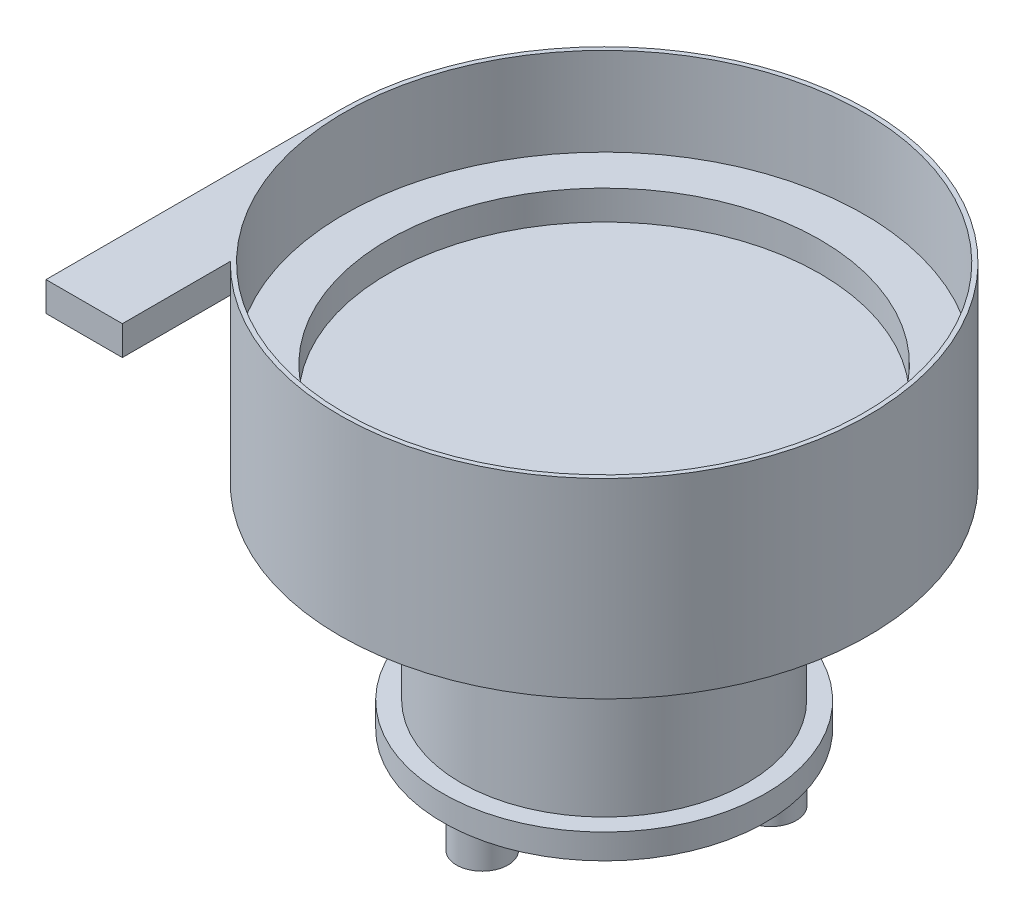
ISO-10303-21;
HEADER;
FILE_DESCRIPTION(('STEP AP214'),'2;1');
FILE_NAME('part.step','',(''),(''),'','','');
FILE_SCHEMA(('AUTOMOTIVE_DESIGN { 1 0 10303 214 1 1 1 1 }'));
ENDSEC;
DATA;
#1=APPLICATION_CONTEXT('core data for automotive mechanical design processes');
#2=APPLICATION_PROTOCOL_DEFINITION('international standard','automotive_design',2000,#1);
#3=PRODUCT_CONTEXT('',#1,'mechanical');
#4=PRODUCT('Part','Part','',(#3));
#5=PRODUCT_RELATED_PRODUCT_CATEGORY('part','',(#4));
#6=PRODUCT_DEFINITION_FORMATION('','',#4);
#7=PRODUCT_DEFINITION_CONTEXT('part definition',#1,'design');
#8=PRODUCT_DEFINITION('design','',#6,#7);
#9=PRODUCT_DEFINITION_SHAPE('','',#8);
#10=(LENGTH_UNIT() NAMED_UNIT(*) SI_UNIT(.MILLI.,.METRE.));
#11=(NAMED_UNIT(*) PLANE_ANGLE_UNIT() SI_UNIT($,.RADIAN.));
#12=(NAMED_UNIT(*) SI_UNIT($,.STERADIAN.) SOLID_ANGLE_UNIT());
#13=UNCERTAINTY_MEASURE_WITH_UNIT(LENGTH_MEASURE(1.E-05),#10,'distance_accuracy_value','');
#14=(GEOMETRIC_REPRESENTATION_CONTEXT(3) GLOBAL_UNCERTAINTY_ASSIGNED_CONTEXT((#13)) GLOBAL_UNIT_ASSIGNED_CONTEXT((#10,
#11,#12)) REPRESENTATION_CONTEXT('',''));
#15=CARTESIAN_POINT('',(0.,0.,0.));
#16=DIRECTION('',(0.,0.,1.));
#17=DIRECTION('',(1.,0.,0.));
#18=AXIS2_PLACEMENT_3D('',#15,#16,#17);
#19=CARTESIAN_POINT('',(0.,0.,0.));
#20=DIRECTION('',(0.,-1.,0.));
#21=DIRECTION('',(0.,0.,-1.));
#22=AXIS2_PLACEMENT_3D('',#19,#20,#21);
#23=CYLINDRICAL_SURFACE('',#22,180.);
#24=CARTESIAN_POINT('',(0.,145.,0.));
#25=DIRECTION('',(0.,-1.,0.));
#26=DIRECTION('',(0.,0.,-1.));
#27=AXIS2_PLACEMENT_3D('',#24,#25,#26);
#28=CIRCLE('',#27,180.);
#29=CARTESIAN_POINT('',(0.,145.,-180.));
#30=VERTEX_POINT('',#29);
#31=EDGE_CURVE('E116',#30,#30,#28,.T.);
#32=ORIENTED_EDGE('',*,*,#31,.F.);
#33=EDGE_LOOP('',(#32));
#34=FACE_BOUND('',#33,.T.);
#35=CARTESIAN_POINT('',(0.,275.,0.));
#36=DIRECTION('',(0.,-1.,0.));
#37=DIRECTION('',(0.,0.,-1.));
#38=AXIS2_PLACEMENT_3D('',#35,#36,#37);
#39=CIRCLE('',#38,180.);
#40=CARTESIAN_POINT('',(-180.,275.,0.));
#41=VERTEX_POINT('',#40);
#42=CARTESIAN_POINT('',(-128.,275.,126.554336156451));
#43=VERTEX_POINT('',#42);
#44=EDGE_CURVE('E111',#41,#43,#39,.T.);
#45=ORIENTED_EDGE('',*,*,#44,.T.);
#46=DIRECTION('',(0.,-1.,0.));
#47=VECTOR('',#46,1.);
#48=CARTESIAN_POINT('',(-128.,0.,126.554336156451));
#49=LINE('',#48,#47);
#50=CARTESIAN_POINT('',(-128.,255.,126.554336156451));
#51=VERTEX_POINT('',#50);
#52=EDGE_CURVE('E74',#43,#51,#49,.T.);
#53=ORIENTED_EDGE('',*,*,#52,.T.);
#54=CARTESIAN_POINT('',(0.,255.,0.));
#55=DIRECTION('',(0.,1.,0.));
#56=DIRECTION('',(0.,0.,1.));
#57=AXIS2_PLACEMENT_3D('',#54,#55,#56);
#58=CIRCLE('',#57,180.);
#59=CARTESIAN_POINT('',(-180.,255.,0.));
#60=VERTEX_POINT('',#59);
#61=EDGE_CURVE('E39',#51,#60,#58,.F.);
#62=ORIENTED_EDGE('',*,*,#61,.T.);
#63=DIRECTION('',(0.,-1.,0.));
#64=VECTOR('',#63,1.);
#65=CARTESIAN_POINT('',(-180.,275.,0.));
#66=LINE('',#65,#64);
#67=EDGE_CURVE('E71',#41,#60,#66,.T.);
#68=ORIENTED_EDGE('',*,*,#67,.F.);
#69=EDGE_LOOP('',(#45,#53,#62,#68));
#70=FACE_BOUND('',#69,.T.);
#71=ADVANCED_FACE('F16',(#34,#70),#23,.T.);
#72=CARTESIAN_POINT('',(0.,215.,0.));
#73=DIRECTION('',(0.,1.,0.));
#74=DIRECTION('',(0.,0.,1.));
#75=AXIS2_PLACEMENT_3D('',#72,#73,#74);
#76=CYLINDRICAL_SURFACE('',#75,177.);
#77=CARTESIAN_POINT('',(0.,275.,0.));
#78=DIRECTION('',(0.,1.,0.));
#79=DIRECTION('',(0.,0.,1.));
#80=AXIS2_PLACEMENT_3D('',#77,#78,#79);
#81=CIRCLE('',#80,177.);
#82=CARTESIAN_POINT('',(0.,275.,177.));
#83=VERTEX_POINT('',#82);
#84=EDGE_CURVE('E87',#83,#83,#81,.T.);
#85=ORIENTED_EDGE('',*,*,#84,.T.);
#86=EDGE_LOOP('',(#85));
#87=FACE_BOUND('',#86,.T.);
#88=CARTESIAN_POINT('',(0.,215.,0.));
#89=DIRECTION('',(0.,1.,0.));
#90=DIRECTION('',(0.,0.,1.));
#91=AXIS2_PLACEMENT_3D('',#88,#89,#90);
#92=CIRCLE('',#91,177.);
#93=CARTESIAN_POINT('',(0.,215.,177.));
#94=VERTEX_POINT('',#93);
#95=EDGE_CURVE('E90',#94,#94,#92,.T.);
#96=ORIENTED_EDGE('',*,*,#95,.F.);
#97=EDGE_LOOP('',(#96));
#98=FACE_BOUND('',#97,.T.);
#99=ADVANCED_FACE('F145',(#87,#98),#76,.F.);
#100=CARTESIAN_POINT('',(0.,0.,0.));
#101=DIRECTION('',(0.,-1.,0.));
#102=DIRECTION('',(0.,0.,-1.));
#103=AXIS2_PLACEMENT_3D('',#100,#101,#102);
#104=PLANE('',#103);
#105=CARTESIAN_POINT('',(-71.8801085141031,0.,-41.5000000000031));
#106=DIRECTION('',(0.,-1.,0.));
#107=DIRECTION('',(0.,0.,-1.));
#108=AXIS2_PLACEMENT_3D('',#105,#106,#107);
#109=CIRCLE('',#108,17.5000000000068);
#110=CARTESIAN_POINT('',(-71.8801085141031,0.,-59.0000000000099));
#111=VERTEX_POINT('',#110);
#112=EDGE_CURVE('E93',#111,#111,#109,.T.);
#113=ORIENTED_EDGE('',*,*,#112,.F.);
#114=EDGE_LOOP('',(#113));
#115=FACE_BOUND('',#114,.T.);
#116=CARTESIAN_POINT('',(71.8801085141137,0.,-41.499999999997));
#117=DIRECTION('',(0.,-1.,0.));
#118=DIRECTION('',(0.,0.,-1.));
#119=AXIS2_PLACEMENT_3D('',#116,#117,#118);
#120=CIRCLE('',#119,17.5000000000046);
#121=CARTESIAN_POINT('',(71.8801085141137,0.,-59.0000000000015));
#122=VERTEX_POINT('',#121);
#123=EDGE_CURVE('E99',#122,#122,#120,.T.);
#124=ORIENTED_EDGE('',*,*,#123,.F.);
#125=EDGE_LOOP('',(#124));
#126=FACE_BOUND('',#125,.T.);
#127=CARTESIAN_POINT('',(0.,0.,83.));
#128=DIRECTION('',(0.,-1.,0.));
#129=DIRECTION('',(0.,0.,-1.));
#130=AXIS2_PLACEMENT_3D('',#127,#128,#129);
#131=CIRCLE('',#130,17.5);
#132=CARTESIAN_POINT('',(0.,0.,65.5));
#133=VERTEX_POINT('',#132);
#134=EDGE_CURVE('E105',#133,#133,#131,.T.);
#135=ORIENTED_EDGE('',*,*,#134,.F.);
#136=EDGE_LOOP('',(#135));
#137=FACE_BOUND('',#136,.T.);
#138=CARTESIAN_POINT('',(0.,0.,0.));
#139=DIRECTION('',(0.,-1.,0.));
#140=DIRECTION('',(0.,0.,-1.));
#141=AXIS2_PLACEMENT_3D('',#138,#139,#140);
#142=CIRCLE('',#141,110.);
#143=CARTESIAN_POINT('',(0.,0.,-110.));
#144=VERTEX_POINT('',#143);
#145=EDGE_CURVE('E11',#144,#144,#142,.T.);
#146=ORIENTED_EDGE('',*,*,#145,.T.);
#147=EDGE_LOOP('',(#146));
#148=FACE_BOUND('',#147,.T.);
#149=ADVANCED_FACE('F18',(#115,#126,#137,#148),#104,.T.);
#150=CARTESIAN_POINT('',(0.,0.,0.));
#151=DIRECTION('',(0.,-1.,0.));
#152=DIRECTION('',(0.,0.,-1.));
#153=AXIS2_PLACEMENT_3D('',#150,#151,#152);
#154=CYLINDRICAL_SURFACE('',#153,110.);
#155=CARTESIAN_POINT('',(0.,17.,0.));
#156=DIRECTION('',(0.,-1.,0.));
#157=DIRECTION('',(0.,0.,-1.));
#158=AXIS2_PLACEMENT_3D('',#155,#156,#157);
#159=CIRCLE('',#158,110.);
#160=CARTESIAN_POINT('',(0.,17.,-110.));
#161=VERTEX_POINT('',#160);
#162=EDGE_CURVE('E24',#161,#161,#159,.T.);
#163=ORIENTED_EDGE('',*,*,#162,.T.);
#164=EDGE_LOOP('',(#163));
#165=FACE_BOUND('',#164,.T.);
#166=ORIENTED_EDGE('',*,*,#145,.F.);
#167=EDGE_LOOP('',(#166));
#168=FACE_BOUND('',#167,.T.);
#169=ADVANCED_FACE('F127',(#165,#168),#154,.T.);
#170=CARTESIAN_POINT('',(110.,17.,0.));
#171=DIRECTION('',(0.,1.,0.));
#172=DIRECTION('',(0.,0.,1.));
#173=AXIS2_PLACEMENT_3D('',#170,#171,#172);
#174=PLANE('',#173);
#175=CARTESIAN_POINT('',(0.,17.,0.));
#176=DIRECTION('',(0.,-1.,0.));
#177=DIRECTION('',(0.,0.,-1.));
#178=AXIS2_PLACEMENT_3D('',#175,#176,#177);
#179=CIRCLE('',#178,97.5);
#180=CARTESIAN_POINT('',(0.,17.,-97.5));
#181=VERTEX_POINT('',#180);
#182=EDGE_CURVE('E122',#181,#181,#179,.T.);
#183=ORIENTED_EDGE('',*,*,#182,.T.);
#184=EDGE_LOOP('',(#183));
#185=FACE_BOUND('',#184,.T.);
#186=ORIENTED_EDGE('',*,*,#162,.F.);
#187=EDGE_LOOP('',(#186));
#188=FACE_BOUND('',#187,.T.);
#189=ADVANCED_FACE('F130',(#185,#188),#174,.T.);
#190=CARTESIAN_POINT('',(0.,0.,0.));
#191=DIRECTION('',(0.,-1.,0.));
#192=DIRECTION('',(0.,0.,-1.));
#193=AXIS2_PLACEMENT_3D('',#190,#191,#192);
#194=CYLINDRICAL_SURFACE('',#193,97.5);
#195=CARTESIAN_POINT('',(0.,145.,0.));
#196=DIRECTION('',(0.,-1.,0.));
#197=DIRECTION('',(0.,0.,-1.));
#198=AXIS2_PLACEMENT_3D('',#195,#196,#197);
#199=CIRCLE('',#198,97.5);
#200=CARTESIAN_POINT('',(0.,145.,-97.5));
#201=VERTEX_POINT('',#200);
#202=EDGE_CURVE('E119',#201,#201,#199,.T.);
#203=ORIENTED_EDGE('',*,*,#202,.T.);
#204=EDGE_LOOP('',(#203));
#205=FACE_BOUND('',#204,.T.);
#206=ORIENTED_EDGE('',*,*,#182,.F.);
#207=EDGE_LOOP('',(#206));
#208=FACE_BOUND('',#207,.T.);
#209=ADVANCED_FACE('F132',(#205,#208),#194,.T.);
#210=CARTESIAN_POINT('',(97.5,145.,0.));
#211=DIRECTION('',(0.,-1.,0.));
#212=DIRECTION('',(0.,0.,-1.));
#213=AXIS2_PLACEMENT_3D('',#210,#211,#212);
#214=PLANE('',#213);
#215=ORIENTED_EDGE('',*,*,#31,.T.);
#216=EDGE_LOOP('',(#215));
#217=FACE_BOUND('',#216,.T.);
#218=ORIENTED_EDGE('',*,*,#202,.F.);
#219=EDGE_LOOP('',(#218));
#220=FACE_BOUND('',#219,.T.);
#221=ADVANCED_FACE('F141',(#217,#220),#214,.T.);
#222=CARTESIAN_POINT('',(180.,275.,0.));
#223=DIRECTION('',(0.,1.,0.));
#224=DIRECTION('',(0.,0.,1.));
#225=AXIS2_PLACEMENT_3D('',#222,#223,#224);
#226=PLANE('',#225);
#227=ORIENTED_EDGE('',*,*,#84,.F.);
#228=EDGE_LOOP('',(#227));
#229=FACE_BOUND('',#228,.T.);
#230=ORIENTED_EDGE('',*,*,#44,.F.);
#231=DIRECTION('',(0.,0.,-1.));
#232=VECTOR('',#231,1.);
#233=CARTESIAN_POINT('',(-180.,275.,200.));
#234=LINE('',#233,#232);
#235=CARTESIAN_POINT('',(-180.,275.,200.));
#236=VERTEX_POINT('',#235);
#237=EDGE_CURVE('E31',#236,#41,#234,.T.);
#238=ORIENTED_EDGE('',*,*,#237,.F.);
#239=DIRECTION('',(-1.,0.,0.));
#240=VECTOR('',#239,1.);
#241=CARTESIAN_POINT('',(-180.,275.,200.));
#242=LINE('',#241,#240);
#243=CARTESIAN_POINT('',(-128.,275.,200.));
#244=VERTEX_POINT('',#243);
#245=EDGE_CURVE('E70',#244,#236,#242,.T.);
#246=ORIENTED_EDGE('',*,*,#245,.F.);
#247=DIRECTION('',(0.,0.,-1.));
#248=VECTOR('',#247,1.);
#249=CARTESIAN_POINT('',(-128.,275.,200.));
#250=LINE('',#249,#248);
#251=EDGE_CURVE('E78',#244,#43,#250,.T.);
#252=ORIENTED_EDGE('',*,*,#251,.T.);
#253=EDGE_LOOP('',(#230,#238,#246,#252));
#254=FACE_BOUND('',#253,.T.);
#255=ADVANCED_FACE('F158',(#229,#254),#226,.T.);
#256=CARTESIAN_POINT('',(0.,-30.,83.));
#257=DIRECTION('',(0.,1.,0.));
#258=DIRECTION('',(0.,0.,1.));
#259=AXIS2_PLACEMENT_3D('',#256,#257,#258);
#260=CYLINDRICAL_SURFACE('',#259,17.5);
#261=CARTESIAN_POINT('',(0.,-30.,83.));
#262=DIRECTION('',(0.,-1.,0.));
#263=DIRECTION('',(0.,0.,-1.));
#264=AXIS2_PLACEMENT_3D('',#261,#262,#263);
#265=CIRCLE('',#264,17.5);
#266=CARTESIAN_POINT('',(0.,-30.,65.5));
#267=VERTEX_POINT('',#266);
#268=EDGE_CURVE('E108',#267,#267,#265,.T.);
#269=ORIENTED_EDGE('',*,*,#268,.F.);
#270=EDGE_LOOP('',(#269));
#271=FACE_BOUND('',#270,.T.);
#272=ORIENTED_EDGE('',*,*,#134,.T.);
#273=EDGE_LOOP('',(#272));
#274=FACE_BOUND('',#273,.T.);
#275=ADVANCED_FACE('F166',(#271,#274),#260,.T.);
#276=CARTESIAN_POINT('',(0.,-30.,83.));
#277=DIRECTION('',(0.,-1.,0.));
#278=DIRECTION('',(0.,0.,-1.));
#279=AXIS2_PLACEMENT_3D('',#276,#277,#278);
#280=PLANE('',#279);
#281=ORIENTED_EDGE('',*,*,#268,.T.);
#282=EDGE_LOOP('',(#281));
#283=FACE_BOUND('',#282,.T.);
#284=ADVANCED_FACE('F176',(#283),#280,.T.);
#285=CARTESIAN_POINT('',(71.8801085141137,-30.,-41.499999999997));
#286=DIRECTION('',(0.,1.,0.));
#287=DIRECTION('',(0.,0.,1.));
#288=AXIS2_PLACEMENT_3D('',#285,#286,#287);
#289=CYLINDRICAL_SURFACE('',#288,17.5000000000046);
#290=CARTESIAN_POINT('',(71.8801085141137,-30.,-41.499999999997));
#291=DIRECTION('',(0.,-1.,0.));
#292=DIRECTION('',(0.,0.,-1.));
#293=AXIS2_PLACEMENT_3D('',#290,#291,#292);
#294=CIRCLE('',#293,17.5000000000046);
#295=CARTESIAN_POINT('',(71.8801085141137,-30.,-59.0000000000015));
#296=VERTEX_POINT('',#295);
#297=EDGE_CURVE('E102',#296,#296,#294,.T.);
#298=ORIENTED_EDGE('',*,*,#297,.F.);
#299=EDGE_LOOP('',(#298));
#300=FACE_BOUND('',#299,.T.);
#301=ORIENTED_EDGE('',*,*,#123,.T.);
#302=EDGE_LOOP('',(#301));
#303=FACE_BOUND('',#302,.T.);
#304=ADVANCED_FACE('F224',(#300,#303),#289,.T.);
#305=CARTESIAN_POINT('',(71.8801085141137,-30.,-41.499999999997));
#306=DIRECTION('',(0.,-1.,0.));
#307=DIRECTION('',(0.,0.,-1.));
#308=AXIS2_PLACEMENT_3D('',#305,#306,#307);
#309=PLANE('',#308);
#310=ORIENTED_EDGE('',*,*,#297,.T.);
#311=EDGE_LOOP('',(#310));
#312=FACE_BOUND('',#311,.T.);
#313=ADVANCED_FACE('F220',(#312),#309,.T.);
#314=CARTESIAN_POINT('',(-71.8801085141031,-30.,-41.5000000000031));
#315=DIRECTION('',(0.,1.,0.));
#316=DIRECTION('',(0.,0.,1.));
#317=AXIS2_PLACEMENT_3D('',#314,#315,#316);
#318=CYLINDRICAL_SURFACE('',#317,17.5000000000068);
#319=CARTESIAN_POINT('',(-71.8801085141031,-30.,-41.5000000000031));
#320=DIRECTION('',(0.,-1.,0.));
#321=DIRECTION('',(0.,0.,-1.));
#322=AXIS2_PLACEMENT_3D('',#319,#320,#321);
#323=CIRCLE('',#322,17.5000000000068);
#324=CARTESIAN_POINT('',(-71.8801085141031,-30.,-59.0000000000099));
#325=VERTEX_POINT('',#324);
#326=EDGE_CURVE('E96',#325,#325,#323,.T.);
#327=ORIENTED_EDGE('',*,*,#326,.F.);
#328=EDGE_LOOP('',(#327));
#329=FACE_BOUND('',#328,.T.);
#330=ORIENTED_EDGE('',*,*,#112,.T.);
#331=EDGE_LOOP('',(#330));
#332=FACE_BOUND('',#331,.T.);
#333=ADVANCED_FACE('F216',(#329,#332),#318,.T.);
#334=CARTESIAN_POINT('',(-71.8801085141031,-30.,-41.5000000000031));
#335=DIRECTION('',(0.,-1.,0.));
#336=DIRECTION('',(0.,0.,-1.));
#337=AXIS2_PLACEMENT_3D('',#334,#335,#336);
#338=PLANE('',#337);
#339=ORIENTED_EDGE('',*,*,#326,.T.);
#340=EDGE_LOOP('',(#339));
#341=FACE_BOUND('',#340,.T.);
#342=ADVANCED_FACE('F211',(#341),#338,.T.);
#343=CARTESIAN_POINT('',(0.,215.,0.));
#344=DIRECTION('',(0.,1.,0.));
#345=DIRECTION('',(0.,0.,1.));
#346=AXIS2_PLACEMENT_3D('',#343,#344,#345);
#347=PLANE('',#346);
#348=CARTESIAN_POINT('',(0.,215.,0.));
#349=DIRECTION('',(0.,1.,0.));
#350=DIRECTION('',(0.,0.,1.));
#351=AXIS2_PLACEMENT_3D('',#348,#349,#350);
#352=CIRCLE('',#351,147.);
#353=CARTESIAN_POINT('',(0.,215.,147.));
#354=VERTEX_POINT('',#353);
#355=EDGE_CURVE('E83',#354,#354,#352,.T.);
#356=ORIENTED_EDGE('',*,*,#355,.F.);
#357=EDGE_LOOP('',(#356));
#358=FACE_BOUND('',#357,.T.);
#359=ORIENTED_EDGE('',*,*,#95,.T.);
#360=EDGE_LOOP('',(#359));
#361=FACE_BOUND('',#360,.T.);
#362=ADVANCED_FACE('F208',(#358,#361),#347,.T.);
#363=CARTESIAN_POINT('',(0.,195.,0.));
#364=DIRECTION('',(0.,1.,0.));
#365=DIRECTION('',(0.,0.,1.));
#366=AXIS2_PLACEMENT_3D('',#363,#364,#365);
#367=CYLINDRICAL_SURFACE('',#366,147.);
#368=CARTESIAN_POINT('',(0.,195.,0.));
#369=DIRECTION('',(0.,1.,0.));
#370=DIRECTION('',(0.,0.,1.));
#371=AXIS2_PLACEMENT_3D('',#368,#369,#370);
#372=CIRCLE('',#371,147.);
#373=CARTESIAN_POINT('',(0.,195.,147.));
#374=VERTEX_POINT('',#373);
#375=EDGE_CURVE('E84',#374,#374,#372,.T.);
#376=ORIENTED_EDGE('',*,*,#375,.F.);
#377=EDGE_LOOP('',(#376));
#378=FACE_BOUND('',#377,.T.);
#379=ORIENTED_EDGE('',*,*,#355,.T.);
#380=EDGE_LOOP('',(#379));
#381=FACE_BOUND('',#380,.T.);
#382=ADVANCED_FACE('F204',(#378,#381),#367,.F.);
#383=CARTESIAN_POINT('',(0.,195.,0.));
#384=DIRECTION('',(0.,1.,0.));
#385=DIRECTION('',(0.,0.,1.));
#386=AXIS2_PLACEMENT_3D('',#383,#384,#385);
#387=PLANE('',#386);
#388=ORIENTED_EDGE('',*,*,#375,.T.);
#389=EDGE_LOOP('',(#388));
#390=FACE_BOUND('',#389,.T.);
#391=ADVANCED_FACE('F201',(#390),#387,.T.);
#392=CARTESIAN_POINT('',(-180.,275.,200.));
#393=DIRECTION('',(1.,0.,0.));
#394=DIRECTION('',(0.,1.,0.));
#395=AXIS2_PLACEMENT_3D('',#392,#393,#394);
#396=PLANE('',#395);
#397=ORIENTED_EDGE('',*,*,#67,.T.);
#398=DIRECTION('',(0.,0.,-1.));
#399=VECTOR('',#398,1.);
#400=CARTESIAN_POINT('',(-180.,255.,200.));
#401=LINE('',#400,#399);
#402=CARTESIAN_POINT('',(-180.,255.,200.));
#403=VERTEX_POINT('',#402);
#404=EDGE_CURVE('E61',#403,#60,#401,.T.);
#405=ORIENTED_EDGE('',*,*,#404,.F.);
#406=DIRECTION('',(0.,-1.,0.));
#407=VECTOR('',#406,1.);
#408=CARTESIAN_POINT('',(-180.,275.,200.));
#409=LINE('',#408,#407);
#410=EDGE_CURVE('E66',#236,#403,#409,.T.);
#411=ORIENTED_EDGE('',*,*,#410,.F.);
#412=ORIENTED_EDGE('',*,*,#237,.T.);
#413=EDGE_LOOP('',(#397,#405,#411,#412));
#414=FACE_BOUND('',#413,.T.);
#415=ADVANCED_FACE('F73',(#414),#396,.F.);
#416=CARTESIAN_POINT('',(-180.,255.,200.));
#417=DIRECTION('',(0.,1.,0.));
#418=DIRECTION('',(0.,0.,1.));
#419=AXIS2_PLACEMENT_3D('',#416,#417,#418);
#420=PLANE('',#419);
#421=ORIENTED_EDGE('',*,*,#61,.F.);
#422=DIRECTION('',(0.,0.,-1.));
#423=VECTOR('',#422,1.);
#424=CARTESIAN_POINT('',(-128.,255.,200.));
#425=LINE('',#424,#423);
#426=CARTESIAN_POINT('',(-128.,255.,200.));
#427=VERTEX_POINT('',#426);
#428=EDGE_CURVE('E62',#427,#51,#425,.T.);
#429=ORIENTED_EDGE('',*,*,#428,.F.);
#430=DIRECTION('',(1.,0.,0.));
#431=VECTOR('',#430,1.);
#432=CARTESIAN_POINT('',(-180.,255.,200.));
#433=LINE('',#432,#431);
#434=EDGE_CURVE('E57',#403,#427,#433,.T.);
#435=ORIENTED_EDGE('',*,*,#434,.F.);
#436=ORIENTED_EDGE('',*,*,#404,.T.);
#437=EDGE_LOOP('',(#421,#429,#435,#436));
#438=FACE_BOUND('',#437,.T.);
#439=ADVANCED_FACE('F59',(#438),#420,.F.);
#440=CARTESIAN_POINT('',(-128.,275.,200.));
#441=DIRECTION('',(-1.,0.,0.));
#442=DIRECTION('',(0.,0.,1.));
#443=AXIS2_PLACEMENT_3D('',#440,#441,#442);
#444=PLANE('',#443);
#445=ORIENTED_EDGE('',*,*,#52,.F.);
#446=ORIENTED_EDGE('',*,*,#251,.F.);
#447=DIRECTION('',(0.,1.,0.));
#448=VECTOR('',#447,1.);
#449=CARTESIAN_POINT('',(-128.,275.,200.));
#450=LINE('',#449,#448);
#451=EDGE_CURVE('E65',#427,#244,#450,.T.);
#452=ORIENTED_EDGE('',*,*,#451,.F.);
#453=ORIENTED_EDGE('',*,*,#428,.T.);
#454=EDGE_LOOP('',(#445,#446,#452,#453));
#455=FACE_BOUND('',#454,.T.);
#456=ADVANCED_FACE('F188',(#455),#444,.F.);
#457=CARTESIAN_POINT('',(0.,0.,200.));
#458=DIRECTION('',(0.,0.,1.));
#459=DIRECTION('',(1.,0.,0.));
#460=AXIS2_PLACEMENT_3D('',#457,#458,#459);
#461=PLANE('',#460);
#462=ORIENTED_EDGE('',*,*,#410,.T.);
#463=ORIENTED_EDGE('',*,*,#434,.T.);
#464=ORIENTED_EDGE('',*,*,#451,.T.);
#465=ORIENTED_EDGE('',*,*,#245,.T.);
#466=EDGE_LOOP('',(#462,#463,#464,#465));
#467=FACE_BOUND('',#466,.T.);
#468=ADVANCED_FACE('F68',(#467),#461,.T.);
#469=CLOSED_SHELL('',(#71,#99,#149,#169,#189,#209,#221,#255,#275,#284,#304,#313,#333,#342,#362,
#382,#391,#415,#439,#456,#468));
#470=MANIFOLD_SOLID_BREP('B1',#469);
#471=ADVANCED_BREP_SHAPE_REPRESENTATION('',(#18,#470),#14);
#472=SHAPE_DEFINITION_REPRESENTATION(#9,#471);
ENDSEC;
END-ISO-10303-21;
